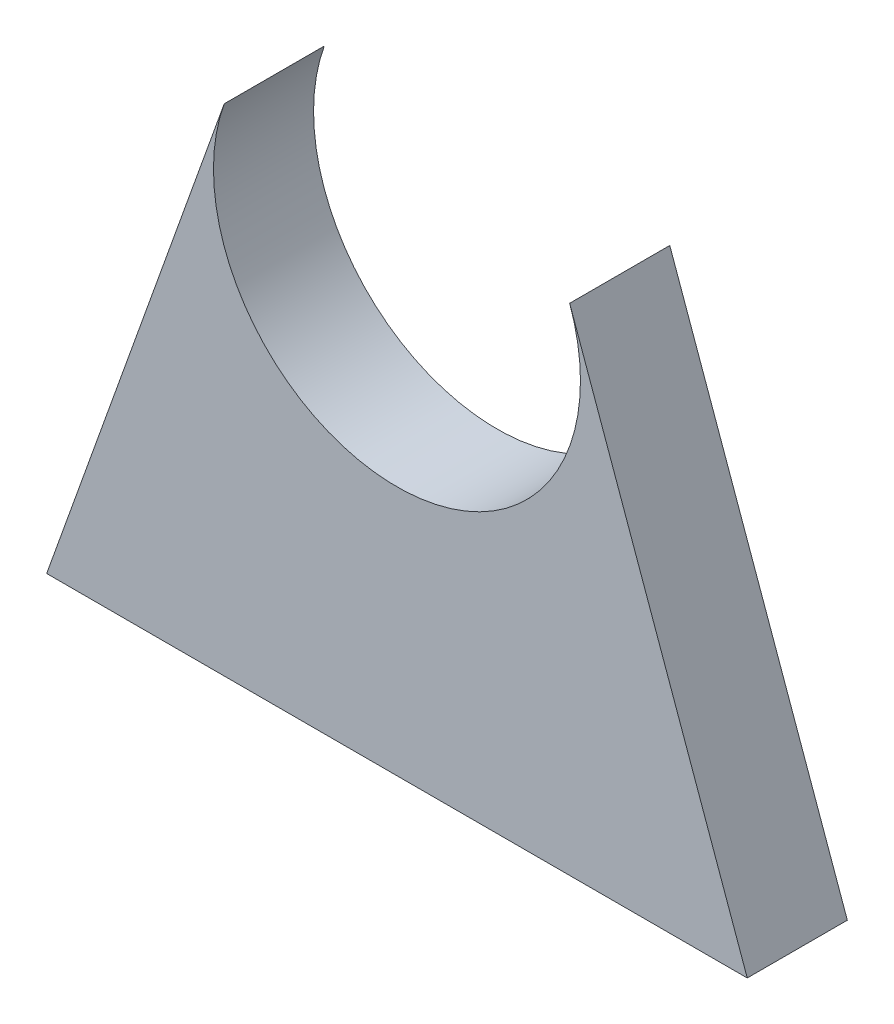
ISO-10303-21;
HEADER;
FILE_DESCRIPTION(('STEP AP214'),'2;1');
FILE_NAME('part.step','',(''),(''),'','','');
FILE_SCHEMA(('AUTOMOTIVE_DESIGN { 1 0 10303 214 1 1 1 1 }'));
ENDSEC;
DATA;
#1=APPLICATION_CONTEXT('core data for automotive mechanical design processes');
#2=APPLICATION_PROTOCOL_DEFINITION('international standard','automotive_design',2000,#1);
#3=PRODUCT_CONTEXT('',#1,'mechanical');
#4=PRODUCT('Part','Part','',(#3));
#5=PRODUCT_RELATED_PRODUCT_CATEGORY('part','',(#4));
#6=PRODUCT_DEFINITION_FORMATION('','',#4);
#7=PRODUCT_DEFINITION_CONTEXT('part definition',#1,'design');
#8=PRODUCT_DEFINITION('design','',#6,#7);
#9=PRODUCT_DEFINITION_SHAPE('','',#8);
#10=(LENGTH_UNIT() NAMED_UNIT(*) SI_UNIT(.MILLI.,.METRE.));
#11=(NAMED_UNIT(*) PLANE_ANGLE_UNIT() SI_UNIT($,.RADIAN.));
#12=(NAMED_UNIT(*) SI_UNIT($,.STERADIAN.) SOLID_ANGLE_UNIT());
#13=UNCERTAINTY_MEASURE_WITH_UNIT(LENGTH_MEASURE(1.E-05),#10,'distance_accuracy_value','');
#14=(GEOMETRIC_REPRESENTATION_CONTEXT(3) GLOBAL_UNCERTAINTY_ASSIGNED_CONTEXT((#13)) GLOBAL_UNIT_ASSIGNED_CONTEXT((#10,
#11,#12)) REPRESENTATION_CONTEXT('',''));
#15=CARTESIAN_POINT('',(0.,0.,0.));
#16=DIRECTION('',(0.,0.,1.));
#17=DIRECTION('',(1.,0.,0.));
#18=AXIS2_PLACEMENT_3D('',#15,#16,#17);
#19=CARTESIAN_POINT('',(-21.,6.,6.));
#20=DIRECTION('',(0.,1.,0.));
#21=DIRECTION('',(0.,0.,1.));
#22=AXIS2_PLACEMENT_3D('',#19,#20,#21);
#23=PLANE('',#22);
#24=DIRECTION('',(1.,0.,0.));
#25=VECTOR('',#24,1.);
#26=CARTESIAN_POINT('',(-21.,6.,0.));
#27=LINE('',#26,#25);
#28=CARTESIAN_POINT('',(-21.,6.,0.));
#29=VERTEX_POINT('',#28);
#30=CARTESIAN_POINT('',(21.,6.,0.));
#31=VERTEX_POINT('',#30);
#32=EDGE_CURVE('E93',#29,#31,#27,.T.);
#33=ORIENTED_EDGE('',*,*,#32,.T.);
#34=DIRECTION('',(0.,0.,-1.));
#35=VECTOR('',#34,1.);
#36=CARTESIAN_POINT('',(21.,6.,6.));
#37=LINE('',#36,#35);
#38=CARTESIAN_POINT('',(21.,6.,6.));
#39=VERTEX_POINT('',#38);
#40=EDGE_CURVE('E11',#39,#31,#37,.T.);
#41=ORIENTED_EDGE('',*,*,#40,.F.);
#42=DIRECTION('',(1.,0.,0.));
#43=VECTOR('',#42,1.);
#44=CARTESIAN_POINT('',(-21.,6.,6.));
#45=LINE('',#44,#43);
#46=CARTESIAN_POINT('',(-21.,6.,6.));
#47=VERTEX_POINT('',#46);
#48=EDGE_CURVE('E81',#47,#39,#45,.T.);
#49=ORIENTED_EDGE('',*,*,#48,.F.);
#50=DIRECTION('',(0.,0.,-1.));
#51=VECTOR('',#50,1.);
#52=CARTESIAN_POINT('',(-21.,6.,6.));
#53=LINE('',#52,#51);
#54=EDGE_CURVE('E89',#47,#29,#53,.T.);
#55=ORIENTED_EDGE('',*,*,#54,.T.);
#56=EDGE_LOOP('',(#33,#41,#49,#55));
#57=FACE_BOUND('',#56,.T.);
#58=ADVANCED_FACE('F30',(#57),#23,.F.);
#59=CARTESIAN_POINT('',(10.3554232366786,35.7101495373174,6.));
#60=DIRECTION('',(-0.94140211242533,-0.337286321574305,0.));
#61=DIRECTION('',(0.337286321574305,-0.94140211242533,0.));
#62=AXIS2_PLACEMENT_3D('',#59,#60,#61);
#63=PLANE('',#62);
#64=DIRECTION('',(-0.337286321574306,0.94140211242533,0.));
#65=VECTOR('',#64,1.);
#66=CARTESIAN_POINT('',(10.3554232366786,35.7101495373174,0.));
#67=LINE('',#66,#65);
#68=CARTESIAN_POINT('',(10.3554232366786,35.7101495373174,0.));
#69=VERTEX_POINT('',#68);
#70=EDGE_CURVE('E85',#31,#69,#67,.T.);
#71=ORIENTED_EDGE('',*,*,#70,.T.);
#72=DIRECTION('',(0.,0.,-1.));
#73=VECTOR('',#72,1.);
#74=CARTESIAN_POINT('',(10.3554232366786,35.7101495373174,6.));
#75=LINE('',#74,#73);
#76=CARTESIAN_POINT('',(10.3554232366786,35.7101495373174,6.));
#77=VERTEX_POINT('',#76);
#78=EDGE_CURVE('E38',#77,#69,#75,.T.);
#79=ORIENTED_EDGE('',*,*,#78,.F.);
#80=DIRECTION('',(-0.337286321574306,0.94140211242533,0.));
#81=VECTOR('',#80,1.);
#82=CARTESIAN_POINT('',(10.3554232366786,35.7101495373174,6.));
#83=LINE('',#82,#81);
#84=EDGE_CURVE('E76',#39,#77,#83,.T.);
#85=ORIENTED_EDGE('',*,*,#84,.F.);
#86=ORIENTED_EDGE('',*,*,#40,.T.);
#87=EDGE_LOOP('',(#71,#79,#85,#86));
#88=FACE_BOUND('',#87,.T.);
#89=ADVANCED_FACE('F84',(#88),#63,.F.);
#90=CARTESIAN_POINT('',(0.,32.,6.));
#91=DIRECTION('',(0.,0.,-1.));
#92=DIRECTION('',(-1.,0.,0.));
#93=AXIS2_PLACEMENT_3D('',#90,#91,#92);
#94=CYLINDRICAL_SURFACE('',#93,11.);
#95=CARTESIAN_POINT('',(0.,32.,0.));
#96=DIRECTION('',(0.,0.,-1.));
#97=DIRECTION('',(1.,0.,0.));
#98=AXIS2_PLACEMENT_3D('',#95,#96,#97);
#99=CIRCLE('',#98,11.);
#100=CARTESIAN_POINT('',(-10.3554232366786,35.7101495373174,0.));
#101=VERTEX_POINT('',#100);
#102=EDGE_CURVE('E63',#69,#101,#99,.T.);
#103=ORIENTED_EDGE('',*,*,#102,.T.);
#104=DIRECTION('',(0.,0.,-1.));
#105=VECTOR('',#104,1.);
#106=CARTESIAN_POINT('',(-10.3554232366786,35.7101495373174,6.));
#107=LINE('',#106,#105);
#108=CARTESIAN_POINT('',(-10.3554232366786,35.7101495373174,6.));
#109=VERTEX_POINT('',#108);
#110=EDGE_CURVE('E86',#109,#101,#107,.T.);
#111=ORIENTED_EDGE('',*,*,#110,.F.);
#112=CARTESIAN_POINT('',(0.,32.,6.));
#113=DIRECTION('',(0.,0.,-1.));
#114=DIRECTION('',(1.,0.,0.));
#115=AXIS2_PLACEMENT_3D('',#112,#113,#114);
#116=CIRCLE('',#115,11.);
#117=EDGE_CURVE('E79',#77,#109,#116,.T.);
#118=ORIENTED_EDGE('',*,*,#117,.F.);
#119=ORIENTED_EDGE('',*,*,#78,.T.);
#120=EDGE_LOOP('',(#103,#111,#118,#119));
#121=FACE_BOUND('',#120,.T.);
#122=ADVANCED_FACE('F87',(#121),#94,.F.);
#123=CARTESIAN_POINT('',(-10.3554232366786,35.7101495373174,6.));
#124=DIRECTION('',(0.94140211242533,-0.337286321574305,0.));
#125=DIRECTION('',(0.337286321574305,0.94140211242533,0.));
#126=AXIS2_PLACEMENT_3D('',#123,#124,#125);
#127=PLANE('',#126);
#128=DIRECTION('',(-0.337286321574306,-0.94140211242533,0.));
#129=VECTOR('',#128,1.);
#130=CARTESIAN_POINT('',(-10.3554232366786,35.7101495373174,0.));
#131=LINE('',#130,#129);
#132=EDGE_CURVE('E69',#101,#29,#131,.T.);
#133=ORIENTED_EDGE('',*,*,#132,.T.);
#134=ORIENTED_EDGE('',*,*,#54,.F.);
#135=DIRECTION('',(-0.337286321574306,-0.94140211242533,0.));
#136=VECTOR('',#135,1.);
#137=CARTESIAN_POINT('',(-10.3554232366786,35.7101495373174,6.));
#138=LINE('',#137,#136);
#139=EDGE_CURVE('E46',#109,#47,#138,.T.);
#140=ORIENTED_EDGE('',*,*,#139,.F.);
#141=ORIENTED_EDGE('',*,*,#110,.T.);
#142=EDGE_LOOP('',(#133,#134,#140,#141));
#143=FACE_BOUND('',#142,.T.);
#144=ADVANCED_FACE('F100',(#143),#127,.F.);
#145=CARTESIAN_POINT('',(0.,32.,6.));
#146=DIRECTION('',(0.,0.,1.));
#147=DIRECTION('',(1.,0.,0.));
#148=AXIS2_PLACEMENT_3D('',#145,#146,#147);
#149=PLANE('',#148);
#150=ORIENTED_EDGE('',*,*,#48,.T.);
#151=ORIENTED_EDGE('',*,*,#84,.T.);
#152=ORIENTED_EDGE('',*,*,#117,.T.);
#153=ORIENTED_EDGE('',*,*,#139,.T.);
#154=EDGE_LOOP('',(#150,#151,#152,#153));
#155=FACE_BOUND('',#154,.T.);
#156=ADVANCED_FACE('F77',(#155),#149,.T.);
#157=CARTESIAN_POINT('',(0.,32.,0.));
#158=DIRECTION('',(0.,0.,1.));
#159=DIRECTION('',(1.,0.,0.));
#160=AXIS2_PLACEMENT_3D('',#157,#158,#159);
#161=PLANE('',#160);
#162=ORIENTED_EDGE('',*,*,#32,.F.);
#163=ORIENTED_EDGE('',*,*,#132,.F.);
#164=ORIENTED_EDGE('',*,*,#102,.F.);
#165=ORIENTED_EDGE('',*,*,#70,.F.);
#166=EDGE_LOOP('',(#162,#163,#164,#165));
#167=FACE_BOUND('',#166,.T.);
#168=ADVANCED_FACE('F103',(#167),#161,.F.);
#169=CLOSED_SHELL('',(#58,#89,#122,#144,#156,#168));
#170=MANIFOLD_SOLID_BREP('B2',#169);
#171=ADVANCED_BREP_SHAPE_REPRESENTATION('',(#18,#170),#14);
#172=SHAPE_DEFINITION_REPRESENTATION(#9,#171);
ENDSEC;
END-ISO-10303-21;
